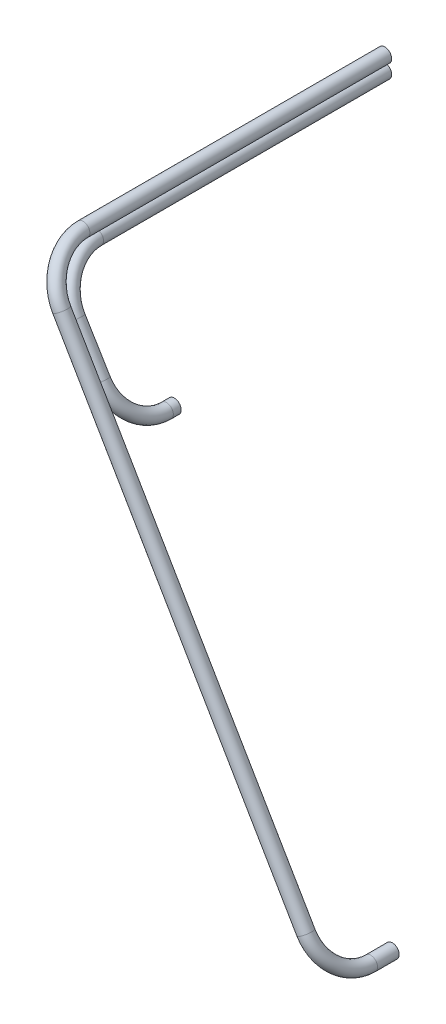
ISO-10303-21;
HEADER;
FILE_DESCRIPTION(('STEP AP214'),'2;1');
FILE_NAME('part.step','',(''),(''),'','','');
FILE_SCHEMA(('AUTOMOTIVE_DESIGN { 1 0 10303 214 1 1 1 1 }'));
ENDSEC;
DATA;
#1=APPLICATION_CONTEXT('core data for automotive mechanical design processes');
#2=APPLICATION_PROTOCOL_DEFINITION('international standard','automotive_design',2000,#1);
#3=PRODUCT_CONTEXT('',#1,'mechanical');
#4=PRODUCT('Part','Part','',(#3));
#5=PRODUCT_RELATED_PRODUCT_CATEGORY('part','',(#4));
#6=PRODUCT_DEFINITION_FORMATION('','',#4);
#7=PRODUCT_DEFINITION_CONTEXT('part definition',#1,'design');
#8=PRODUCT_DEFINITION('design','',#6,#7);
#9=PRODUCT_DEFINITION_SHAPE('','',#8);
#10=(LENGTH_UNIT() NAMED_UNIT(*) SI_UNIT(.MILLI.,.METRE.));
#11=(NAMED_UNIT(*) PLANE_ANGLE_UNIT() SI_UNIT($,.RADIAN.));
#12=(NAMED_UNIT(*) SI_UNIT($,.STERADIAN.) SOLID_ANGLE_UNIT());
#13=UNCERTAINTY_MEASURE_WITH_UNIT(LENGTH_MEASURE(1.E-05),#10,'distance_accuracy_value','');
#14=(GEOMETRIC_REPRESENTATION_CONTEXT(3) GLOBAL_UNCERTAINTY_ASSIGNED_CONTEXT((#13)) GLOBAL_UNIT_ASSIGNED_CONTEXT((#10,
#11,#12)) REPRESENTATION_CONTEXT('',''));
#15=CARTESIAN_POINT('',(0.,0.,0.));
#16=DIRECTION('',(0.,0.,1.));
#17=DIRECTION('',(1.,0.,0.));
#18=AXIS2_PLACEMENT_3D('',#15,#16,#17);
#19=CARTESIAN_POINT('',(-361.,-123.18,18.0548000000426));
#20=DIRECTION('',(0.,0.,-1.));
#21=DIRECTION('',(-1.,0.,0.));
#22=AXIS2_PLACEMENT_3D('',#19,#20,#21);
#23=CYLINDRICAL_SURFACE('',#22,1.58749999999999);
#24=CARTESIAN_POINT('',(-361.,-123.18,18.0548000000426));
#25=DIRECTION('',(0.,0.,-1.));
#26=DIRECTION('',(0.464011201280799,0.88582933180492,0.));
#27=AXIS2_PLACEMENT_3D('',#24,#25,#26);
#28=CIRCLE('',#27,1.58749999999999);
#29=CARTESIAN_POINT('',(-361.821819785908,-121.82177745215,18.0548000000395));
#30=VERTEX_POINT('',#29);
#31=EDGE_CURVE('E47',#30,#30,#28,.T.);
#32=ORIENTED_EDGE('',*,*,#31,.T.);
#33=EDGE_LOOP('',(#32));
#34=FACE_BOUND('',#33,.T.);
#35=CARTESIAN_POINT('',(-361.,-123.18,-48.7651999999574));
#36=DIRECTION('',(0.,0.,-1.));
#37=DIRECTION('',(0.464011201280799,0.88582933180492,0.));
#38=AXIS2_PLACEMENT_3D('',#35,#36,#37);
#39=CIRCLE('',#38,1.58749999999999);
#40=CARTESIAN_POINT('',(-360.263382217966,-121.77374593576,-48.7651999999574));
#41=VERTEX_POINT('',#40);
#42=EDGE_CURVE('E11',#41,#41,#39,.T.);
#43=ORIENTED_EDGE('',*,*,#42,.F.);
#44=EDGE_LOOP('',(#43));
#45=FACE_BOUND('',#44,.T.);
#46=ADVANCED_FACE('F37',(#34,#45),#23,.T.);
#47=CARTESIAN_POINT('',(-361.,-123.18,18.0548000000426));
#48=DIRECTION('',(0.,0.,-1.));
#49=DIRECTION('',(-1.,0.,0.));
#50=AXIS2_PLACEMENT_3D('',#47,#48,#49);
#51=CYLINDRICAL_SURFACE('',#50,0.793750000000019);
#52=CARTESIAN_POINT('',(-361.,-123.18,18.0548000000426));
#53=DIRECTION('',(0.,0.,-1.));
#54=DIRECTION('',(0.464011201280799,0.88582933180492,0.));
#55=AXIS2_PLACEMENT_3D('',#52,#53,#54);
#56=CIRCLE('',#55,0.793750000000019);
#57=CARTESIAN_POINT('',(-361.410909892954,-122.500888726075,18.0548000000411));
#58=VERTEX_POINT('',#57);
#59=EDGE_CURVE('E51',#58,#58,#56,.T.);
#60=ORIENTED_EDGE('',*,*,#59,.F.);
#61=EDGE_LOOP('',(#60));
#62=FACE_BOUND('',#61,.T.);
#63=CARTESIAN_POINT('',(-361.,-123.18,-48.7651999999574));
#64=DIRECTION('',(0.,0.,-1.));
#65=DIRECTION('',(0.464011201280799,0.88582933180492,0.));
#66=AXIS2_PLACEMENT_3D('',#63,#64,#65);
#67=CIRCLE('',#66,0.793750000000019);
#68=CARTESIAN_POINT('',(-360.631691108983,-122.47687296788,-48.7651999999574));
#69=VERTEX_POINT('',#68);
#70=EDGE_CURVE('E43',#69,#69,#67,.T.);
#71=ORIENTED_EDGE('',*,*,#70,.T.);
#72=EDGE_LOOP('',(#71));
#73=FACE_BOUND('',#72,.T.);
#74=ADVANCED_FACE('F105',(#62,#73),#51,.F.);
#75=CARTESIAN_POINT('',(-355.823182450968,-131.735732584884,18.0548000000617));
#76=DIRECTION('',(-0.855573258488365,-0.517681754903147,0.));
#77=DIRECTION('',(0.517681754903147,-0.855573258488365,0.));
#78=AXIS2_PLACEMENT_3D('',#75,#76,#77);
#79=TOROIDAL_SURFACE('',#78,9.99999999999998,1.58749999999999);
#80=CARTESIAN_POINT('',(-355.823182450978,-131.735732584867,28.0548000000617));
#81=DIRECTION('',(-0.517681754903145,0.855573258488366,0.));
#82=DIRECTION('',(0.7320056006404,0.442914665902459,0.517681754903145));
#83=AXIS2_PLACEMENT_3D('',#80,#81,#82);
#84=CIRCLE('',#83,1.58749999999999);
#85=CARTESIAN_POINT('',(-355.82318245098,-131.735732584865,29.6423000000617));
#86=VERTEX_POINT('',#85);
#87=EDGE_CURVE('E56',#86,#86,#84,.T.);
#88=CARTESIAN_POINT('',(-355.823182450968,-131.735732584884,18.0548000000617));
#89=DIRECTION('',(-0.855573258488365,-0.517681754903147,0.));
#90=DIRECTION('',(0.517681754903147,-0.855573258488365,0.));
#91=AXIS2_PLACEMENT_3D('',#88,#89,#90);
#92=CIRCLE('',#91,11.5875);
#93=EDGE_CURVE('',#86,#30,#92,.T.);
#94=ORIENTED_EDGE('',*,*,#87,.T.);
#95=ORIENTED_EDGE('',*,*,#31,.F.);
#96=ORIENTED_EDGE('',*,*,#93,.T.);
#97=ORIENTED_EDGE('',*,*,#93,.F.);
#98=EDGE_LOOP('',(#94,#96,#95,#97));
#99=FACE_BOUND('',#98,.T.);
#100=ADVANCED_FACE('F101',(#99),#79,.T.);
#101=CARTESIAN_POINT('',(-355.823182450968,-131.735732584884,18.0548000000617));
#102=DIRECTION('',(-0.855573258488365,-0.517681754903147,0.));
#103=DIRECTION('',(0.517681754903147,-0.855573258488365,0.));
#104=AXIS2_PLACEMENT_3D('',#101,#102,#103);
#105=TOROIDAL_SURFACE('',#104,9.99999999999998,0.793750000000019);
#106=CARTESIAN_POINT('',(-355.823182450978,-131.735732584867,28.0548000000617));
#107=DIRECTION('',(-0.517681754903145,0.855573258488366,0.));
#108=DIRECTION('',(0.7320056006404,0.442914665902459,0.517681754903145));
#109=AXIS2_PLACEMENT_3D('',#106,#107,#108);
#110=CIRCLE('',#109,0.793750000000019);
#111=CARTESIAN_POINT('',(-355.823182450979,-131.735732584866,28.8485500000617));
#112=VERTEX_POINT('',#111);
#113=EDGE_CURVE('E59',#112,#112,#110,.T.);
#114=CARTESIAN_POINT('',(-355.823182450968,-131.735732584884,18.0548000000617));
#115=DIRECTION('',(-0.855573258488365,-0.517681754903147,0.));
#116=DIRECTION('',(0.517681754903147,-0.855573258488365,0.));
#117=AXIS2_PLACEMENT_3D('',#114,#115,#116);
#118=CIRCLE('',#117,10.79375);
#119=EDGE_CURVE('',#112,#58,#118,.T.);
#120=ORIENTED_EDGE('',*,*,#113,.F.);
#121=ORIENTED_EDGE('',*,*,#59,.T.);
#122=ORIENTED_EDGE('',*,*,#119,.T.);
#123=ORIENTED_EDGE('',*,*,#119,.F.);
#124=EDGE_LOOP('',(#120,#122,#121,#123));
#125=FACE_BOUND('',#124,.T.);
#126=ADVANCED_FACE('F98',(#125),#105,.F.);
#127=CARTESIAN_POINT('',(-349.991405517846,-141.373917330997,28.0548000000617));
#128=DIRECTION('',(-0.517681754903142,0.855573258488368,0.));
#129=DIRECTION('',(-0.855573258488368,-0.517681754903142,0.));
#130=AXIS2_PLACEMENT_3D('',#127,#128,#129);
#131=CYLINDRICAL_SURFACE('',#130,1.58749999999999);
#132=CARTESIAN_POINT('',(-349.991405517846,-141.373917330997,28.0548000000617));
#133=DIRECTION('',(-0.517681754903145,0.855573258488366,0.));
#134=DIRECTION('',(0.7320056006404,0.442914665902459,0.517681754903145));
#135=AXIS2_PLACEMENT_3D('',#132,#133,#134);
#136=CIRCLE('',#135,1.58749999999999);
#137=CARTESIAN_POINT('',(-349.991405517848,-141.373917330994,29.6423000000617));
#138=VERTEX_POINT('',#137);
#139=EDGE_CURVE('E62',#138,#138,#136,.T.);
#140=ORIENTED_EDGE('',*,*,#139,.T.);
#141=EDGE_LOOP('',(#140));
#142=FACE_BOUND('',#141,.T.);
#143=ORIENTED_EDGE('',*,*,#87,.F.);
#144=EDGE_LOOP('',(#143));
#145=FACE_BOUND('',#144,.T.);
#146=ADVANCED_FACE('F94',(#142,#145),#131,.T.);
#147=CARTESIAN_POINT('',(-349.991405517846,-141.373917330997,28.0548000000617));
#148=DIRECTION('',(-0.517681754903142,0.855573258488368,0.));
#149=DIRECTION('',(-0.855573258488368,-0.517681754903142,0.));
#150=AXIS2_PLACEMENT_3D('',#147,#148,#149);
#151=CYLINDRICAL_SURFACE('',#150,0.793750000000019);
#152=CARTESIAN_POINT('',(-349.991405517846,-141.373917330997,28.0548000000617));
#153=DIRECTION('',(-0.517681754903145,0.855573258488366,0.));
#154=DIRECTION('',(0.7320056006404,0.442914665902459,0.517681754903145));
#155=AXIS2_PLACEMENT_3D('',#152,#153,#154);
#156=CIRCLE('',#155,0.793750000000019);
#157=CARTESIAN_POINT('',(-349.991405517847,-141.373917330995,28.8485500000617));
#158=VERTEX_POINT('',#157);
#159=EDGE_CURVE('E65',#158,#158,#156,.T.);
#160=ORIENTED_EDGE('',*,*,#159,.F.);
#161=EDGE_LOOP('',(#160));
#162=FACE_BOUND('',#161,.T.);
#163=ORIENTED_EDGE('',*,*,#113,.T.);
#164=EDGE_LOOP('',(#163));
#165=FACE_BOUND('',#164,.T.);
#166=ADVANCED_FACE('F91',(#162,#165),#151,.F.);
#167=CARTESIAN_POINT('',(-349.991405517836,-141.373917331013,18.0548000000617));
#168=DIRECTION('',(-0.855573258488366,-0.517681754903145,0.));
#169=DIRECTION('',(0.517681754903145,-0.855573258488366,0.));
#170=AXIS2_PLACEMENT_3D('',#167,#168,#169);
#171=TOROIDAL_SURFACE('',#170,9.99999999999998,1.58749999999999);
#172=CARTESIAN_POINT('',(-344.814587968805,-149.929649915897,18.0548000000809));
#173=DIRECTION('',(0.,0.,1.));
#174=DIRECTION('',(1.,0.,0.));
#175=AXIS2_PLACEMENT_3D('',#172,#173,#174);
#176=CIRCLE('',#175,1.58749999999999);
#177=CARTESIAN_POINT('',(-343.992768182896,-151.287872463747,18.0548000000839));
#178=VERTEX_POINT('',#177);
#179=EDGE_CURVE('E68',#178,#178,#176,.T.);
#180=CARTESIAN_POINT('',(-349.991405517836,-141.373917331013,18.0548000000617));
#181=DIRECTION('',(-0.855573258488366,-0.517681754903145,0.));
#182=DIRECTION('',(0.517681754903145,-0.855573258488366,0.));
#183=AXIS2_PLACEMENT_3D('',#180,#181,#182);
#184=CIRCLE('',#183,11.5875);
#185=EDGE_CURVE('',#178,#138,#184,.T.);
#186=ORIENTED_EDGE('',*,*,#179,.T.);
#187=ORIENTED_EDGE('',*,*,#139,.F.);
#188=ORIENTED_EDGE('',*,*,#185,.T.);
#189=ORIENTED_EDGE('',*,*,#185,.F.);
#190=EDGE_LOOP('',(#186,#188,#187,#189));
#191=FACE_BOUND('',#190,.T.);
#192=ADVANCED_FACE('F87',(#191),#171,.T.);
#193=CARTESIAN_POINT('',(-349.991405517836,-141.373917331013,18.0548000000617));
#194=DIRECTION('',(-0.855573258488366,-0.517681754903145,0.));
#195=DIRECTION('',(0.517681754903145,-0.855573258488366,0.));
#196=AXIS2_PLACEMENT_3D('',#193,#194,#195);
#197=TOROIDAL_SURFACE('',#196,9.99999999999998,0.793750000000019);
#198=CARTESIAN_POINT('',(-344.814587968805,-149.929649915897,18.0548000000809));
#199=DIRECTION('',(0.,0.,1.));
#200=DIRECTION('',(1.,0.,0.));
#201=AXIS2_PLACEMENT_3D('',#198,#199,#200);
#202=CIRCLE('',#201,0.793750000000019);
#203=CARTESIAN_POINT('',(-344.403678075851,-150.608761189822,18.0548000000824));
#204=VERTEX_POINT('',#203);
#205=EDGE_CURVE('E72',#204,#204,#202,.T.);
#206=CARTESIAN_POINT('',(-349.991405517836,-141.373917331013,18.0548000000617));
#207=DIRECTION('',(-0.855573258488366,-0.517681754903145,0.));
#208=DIRECTION('',(0.517681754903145,-0.855573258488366,0.));
#209=AXIS2_PLACEMENT_3D('',#206,#207,#208);
#210=CIRCLE('',#209,10.79375);
#211=EDGE_CURVE('',#204,#158,#210,.T.);
#212=ORIENTED_EDGE('',*,*,#205,.F.);
#213=ORIENTED_EDGE('',*,*,#159,.T.);
#214=ORIENTED_EDGE('',*,*,#211,.T.);
#215=ORIENTED_EDGE('',*,*,#211,.F.);
#216=EDGE_LOOP('',(#212,#214,#213,#215));
#217=FACE_BOUND('',#216,.T.);
#218=ADVANCED_FACE('F84',(#217),#197,.F.);
#219=CARTESIAN_POINT('',(-344.814587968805,-149.929649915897,18.0548000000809));
#220=DIRECTION('',(0.,0.,-1.));
#221=DIRECTION('',(-1.,0.,0.));
#222=AXIS2_PLACEMENT_3D('',#219,#220,#221);
#223=CYLINDRICAL_SURFACE('',#222,0.793750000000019);
#224=ORIENTED_EDGE('',*,*,#205,.T.);
#225=EDGE_LOOP('',(#224));
#226=FACE_BOUND('',#225,.T.);
#227=CARTESIAN_POINT('',(-344.814587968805,-149.929649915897,16.2348));
#228=DIRECTION('',(0.,0.,1.));
#229=DIRECTION('',(1.,0.,0.));
#230=AXIS2_PLACEMENT_3D('',#227,#228,#229);
#231=CIRCLE('',#230,0.793750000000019);
#232=CARTESIAN_POINT('',(-344.020837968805,-149.929649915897,16.2348));
#233=VERTEX_POINT('',#232);
#234=EDGE_CURVE('E73',#233,#233,#231,.T.);
#235=ORIENTED_EDGE('',*,*,#234,.F.);
#236=EDGE_LOOP('',(#235));
#237=FACE_BOUND('',#236,.T.);
#238=ADVANCED_FACE('F81',(#226,#237),#223,.F.);
#239=CARTESIAN_POINT('',(-344.814587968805,-149.929649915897,18.0548000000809));
#240=DIRECTION('',(0.,0.,-1.));
#241=DIRECTION('',(-1.,0.,0.));
#242=AXIS2_PLACEMENT_3D('',#239,#240,#241);
#243=CYLINDRICAL_SURFACE('',#242,1.58749999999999);
#244=ORIENTED_EDGE('',*,*,#179,.F.);
#245=EDGE_LOOP('',(#244));
#246=FACE_BOUND('',#245,.T.);
#247=CARTESIAN_POINT('',(-344.814587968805,-149.929649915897,16.2348));
#248=DIRECTION('',(0.,0.,1.));
#249=DIRECTION('',(1.,0.,0.));
#250=AXIS2_PLACEMENT_3D('',#247,#248,#249);
#251=CIRCLE('',#250,1.58749999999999);
#252=CARTESIAN_POINT('',(-343.227087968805,-149.929649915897,16.2348));
#253=VERTEX_POINT('',#252);
#254=EDGE_CURVE('E69',#253,#253,#251,.T.);
#255=ORIENTED_EDGE('',*,*,#254,.T.);
#256=EDGE_LOOP('',(#255));
#257=FACE_BOUND('',#256,.T.);
#258=ADVANCED_FACE('F123',(#246,#257),#243,.T.);
#259=CARTESIAN_POINT('',(-361.,-123.18,-48.7651999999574));
#260=DIRECTION('',(0.,0.,-1.));
#261=DIRECTION('',(0.464011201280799,0.88582933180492,0.));
#262=AXIS2_PLACEMENT_3D('',#259,#260,#261);
#263=PLANE('',#262);
#264=ORIENTED_EDGE('',*,*,#70,.F.);
#265=EDGE_LOOP('',(#264));
#266=FACE_BOUND('',#265,.T.);
#267=ORIENTED_EDGE('',*,*,#42,.T.);
#268=EDGE_LOOP('',(#267));
#269=FACE_BOUND('',#268,.T.);
#270=ADVANCED_FACE('F126',(#266,#269),#263,.T.);
#271=CARTESIAN_POINT('',(-344.814587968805,-149.929649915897,16.2348));
#272=DIRECTION('',(0.,0.,1.));
#273=DIRECTION('',(1.,0.,0.));
#274=AXIS2_PLACEMENT_3D('',#271,#272,#273);
#275=PLANE('',#274);
#276=ORIENTED_EDGE('',*,*,#234,.T.);
#277=EDGE_LOOP('',(#276));
#278=FACE_BOUND('',#277,.T.);
#279=ORIENTED_EDGE('',*,*,#254,.F.);
#280=EDGE_LOOP('',(#279));
#281=FACE_BOUND('',#280,.T.);
#282=ADVANCED_FACE('F128',(#278,#281),#275,.F.);
#283=CLOSED_SHELL('',(#46,#74,#100,#126,#146,#166,#192,#218,#238,#258,#270,#282));
#284=MANIFOLD_SOLID_BREP('B2',#283);
#285=CARTESIAN_POINT('',(-361.,-120.,21.2348000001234));
#286=DIRECTION('',(0.,0.,-1.));
#287=DIRECTION('',(-1.,0.,0.));
#288=AXIS2_PLACEMENT_3D('',#285,#286,#287);
#289=CYLINDRICAL_SURFACE('',#288,1.58750000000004);
#290=CARTESIAN_POINT('',(-361.,-120.,21.2348000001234));
#291=DIRECTION('',(0.,0.,-1.));
#292=DIRECTION('',(0.489937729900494,0.871757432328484,0.));
#293=AXIS2_PLACEMENT_3D('',#290,#291,#292);
#294=CIRCLE('',#293,1.58750000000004);
#295=CARTESIAN_POINT('',(-361.801697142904,-118.629803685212,21.2348000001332));
#296=VERTEX_POINT('',#295);
#297=EDGE_CURVE('E229',#296,#296,#294,.T.);
#298=ORIENTED_EDGE('',*,*,#297,.T.);
#299=EDGE_LOOP('',(#298));
#300=FACE_BOUND('',#299,.T.);
#301=CARTESIAN_POINT('',(-361.,-120.,-48.7651999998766));
#302=DIRECTION('',(0.,0.,-1.));
#303=DIRECTION('',(0.489937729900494,0.871757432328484,0.));
#304=AXIS2_PLACEMENT_3D('',#301,#302,#303);
#305=CIRCLE('',#304,1.58750000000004);
#306=CARTESIAN_POINT('',(-360.222223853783,-118.616085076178,-48.7651999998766));
#307=VERTEX_POINT('',#306);
#308=EDGE_CURVE('E36',#307,#307,#305,.T.);
#309=ORIENTED_EDGE('',*,*,#308,.F.);
#310=EDGE_LOOP('',(#309));
#311=FACE_BOUND('',#310,.T.);
#312=ADVANCED_FACE('F219',(#300,#311),#289,.T.);
#313=CARTESIAN_POINT('',(-361.,-120.,21.2348000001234));
#314=DIRECTION('',(0.,0.,-1.));
#315=DIRECTION('',(-1.,0.,0.));
#316=AXIS2_PLACEMENT_3D('',#313,#314,#315);
#317=CYLINDRICAL_SURFACE('',#316,0.793749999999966);
#318=CARTESIAN_POINT('',(-361.,-120.,21.2348000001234));
#319=DIRECTION('',(0.,0.,-1.));
#320=DIRECTION('',(0.489937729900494,0.871757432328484,0.));
#321=AXIS2_PLACEMENT_3D('',#318,#319,#320);
#322=CIRCLE('',#321,0.793749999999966);
#323=CARTESIAN_POINT('',(-361.400848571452,-119.314901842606,21.2348000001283));
#324=VERTEX_POINT('',#323);
#325=EDGE_CURVE('E233',#324,#324,#322,.T.);
#326=ORIENTED_EDGE('',*,*,#325,.F.);
#327=EDGE_LOOP('',(#326));
#328=FACE_BOUND('',#327,.T.);
#329=CARTESIAN_POINT('',(-361.,-120.,-48.7651999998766));
#330=DIRECTION('',(0.,0.,-1.));
#331=DIRECTION('',(0.489937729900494,0.871757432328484,0.));
#332=AXIS2_PLACEMENT_3D('',#329,#330,#331);
#333=CIRCLE('',#332,0.793749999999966);
#334=CARTESIAN_POINT('',(-360.611111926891,-119.308042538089,-48.7651999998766));
#335=VERTEX_POINT('',#334);
#336=EDGE_CURVE('E225',#335,#335,#333,.T.);
#337=ORIENTED_EDGE('',*,*,#336,.T.);
#338=EDGE_LOOP('',(#337));
#339=FACE_BOUND('',#338,.T.);
#340=ADVANCED_FACE('F287',(#328,#339),#317,.F.);
#341=CARTESIAN_POINT('',(-355.949939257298,-128.631157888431,21.2348000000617));
#342=DIRECTION('',(-0.863115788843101,-0.505006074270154,0.));
#343=DIRECTION('',(0.505006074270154,-0.863115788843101,0.));
#344=AXIS2_PLACEMENT_3D('',#341,#342,#343);
#345=TOROIDAL_SURFACE('',#344,10.,1.58750000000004);
#346=CARTESIAN_POINT('',(-355.949939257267,-128.631157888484,31.2348000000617));
#347=DIRECTION('',(-0.505006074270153,0.863115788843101,0.));
#348=DIRECTION('',(0.744968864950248,0.43587871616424,0.505006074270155));
#349=AXIS2_PLACEMENT_3D('',#346,#347,#348);
#350=CIRCLE('',#349,1.58750000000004);
#351=CARTESIAN_POINT('',(-355.949939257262,-128.631157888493,32.8223000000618));
#352=VERTEX_POINT('',#351);
#353=EDGE_CURVE('E238',#352,#352,#350,.T.);
#354=CARTESIAN_POINT('',(-355.949939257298,-128.631157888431,21.2348000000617));
#355=DIRECTION('',(-0.863115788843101,-0.505006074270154,0.));
#356=DIRECTION('',(0.505006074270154,-0.863115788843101,0.));
#357=AXIS2_PLACEMENT_3D('',#354,#355,#356);
#358=CIRCLE('',#357,11.5875000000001);
#359=EDGE_CURVE('',#352,#296,#358,.T.);
#360=ORIENTED_EDGE('',*,*,#353,.T.);
#361=ORIENTED_EDGE('',*,*,#297,.F.);
#362=ORIENTED_EDGE('',*,*,#359,.T.);
#363=ORIENTED_EDGE('',*,*,#359,.F.);
#364=EDGE_LOOP('',(#360,#362,#361,#363));
#365=FACE_BOUND('',#364,.T.);
#366=ADVANCED_FACE('F283',(#365),#345,.T.);
#367=CARTESIAN_POINT('',(-355.949939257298,-128.631157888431,21.2348000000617));
#368=DIRECTION('',(-0.863115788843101,-0.505006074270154,0.));
#369=DIRECTION('',(0.505006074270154,-0.863115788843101,0.));
#370=AXIS2_PLACEMENT_3D('',#367,#368,#369);
#371=TOROIDAL_SURFACE('',#370,10.,0.793749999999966);
#372=CARTESIAN_POINT('',(-355.949939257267,-128.631157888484,31.2348000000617));
#373=DIRECTION('',(-0.505006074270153,0.863115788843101,0.));
#374=DIRECTION('',(0.744968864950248,0.43587871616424,0.505006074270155));
#375=AXIS2_PLACEMENT_3D('',#372,#373,#374);
#376=CIRCLE('',#375,0.793749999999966);
#377=CARTESIAN_POINT('',(-355.949939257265,-128.631157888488,32.0285500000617));
#378=VERTEX_POINT('',#377);
#379=EDGE_CURVE('E241',#378,#378,#376,.T.);
#380=CARTESIAN_POINT('',(-355.949939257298,-128.631157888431,21.2348000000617));
#381=DIRECTION('',(-0.863115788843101,-0.505006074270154,0.));
#382=DIRECTION('',(0.505006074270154,-0.863115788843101,0.));
#383=AXIS2_PLACEMENT_3D('',#380,#381,#382);
#384=CIRCLE('',#383,10.79375);
#385=EDGE_CURVE('',#378,#324,#384,.T.);
#386=ORIENTED_EDGE('',*,*,#379,.F.);
#387=ORIENTED_EDGE('',*,*,#325,.T.);
#388=ORIENTED_EDGE('',*,*,#385,.T.);
#389=ORIENTED_EDGE('',*,*,#385,.F.);
#390=EDGE_LOOP('',(#386,#388,#387,#389));
#391=FACE_BOUND('',#390,.T.);
#392=ADVANCED_FACE('F280',(#391),#371,.F.);
#393=CARTESIAN_POINT('',(-299.310727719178,-225.434345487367,31.2348000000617));
#394=DIRECTION('',(-0.505006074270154,0.863115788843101,0.));
#395=DIRECTION('',(-0.863115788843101,-0.505006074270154,0.));
#396=AXIS2_PLACEMENT_3D('',#393,#394,#395);
#397=CYLINDRICAL_SURFACE('',#396,1.58750000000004);
#398=CARTESIAN_POINT('',(-299.310727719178,-225.434345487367,31.2348000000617));
#399=DIRECTION('',(-0.505006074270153,0.863115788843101,0.));
#400=DIRECTION('',(0.744968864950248,0.43587871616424,0.505006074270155));
#401=AXIS2_PLACEMENT_3D('',#398,#399,#400);
#402=CIRCLE('',#401,1.58750000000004);
#403=CARTESIAN_POINT('',(-299.310727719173,-225.434345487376,32.8223000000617));
#404=VERTEX_POINT('',#403);
#405=EDGE_CURVE('E244',#404,#404,#402,.T.);
#406=ORIENTED_EDGE('',*,*,#405,.T.);
#407=EDGE_LOOP('',(#406));
#408=FACE_BOUND('',#407,.T.);
#409=ORIENTED_EDGE('',*,*,#353,.F.);
#410=EDGE_LOOP('',(#409));
#411=FACE_BOUND('',#410,.T.);
#412=ADVANCED_FACE('F276',(#408,#411),#397,.T.);
#413=CARTESIAN_POINT('',(-299.310727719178,-225.434345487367,31.2348000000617));
#414=DIRECTION('',(-0.505006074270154,0.863115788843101,0.));
#415=DIRECTION('',(-0.863115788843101,-0.505006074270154,0.));
#416=AXIS2_PLACEMENT_3D('',#413,#414,#415);
#417=CYLINDRICAL_SURFACE('',#416,0.793749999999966);
#418=CARTESIAN_POINT('',(-299.310727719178,-225.434345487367,31.2348000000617));
#419=DIRECTION('',(-0.505006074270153,0.863115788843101,0.));
#420=DIRECTION('',(0.744968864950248,0.43587871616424,0.505006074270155));
#421=AXIS2_PLACEMENT_3D('',#418,#419,#420);
#422=CIRCLE('',#421,0.793749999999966);
#423=CARTESIAN_POINT('',(-299.310727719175,-225.434345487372,32.0285500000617));
#424=VERTEX_POINT('',#423);
#425=EDGE_CURVE('E247',#424,#424,#422,.T.);
#426=ORIENTED_EDGE('',*,*,#425,.F.);
#427=EDGE_LOOP('',(#426));
#428=FACE_BOUND('',#427,.T.);
#429=ORIENTED_EDGE('',*,*,#379,.T.);
#430=EDGE_LOOP('',(#429));
#431=FACE_BOUND('',#430,.T.);
#432=ADVANCED_FACE('F273',(#428,#431),#417,.F.);
#433=CARTESIAN_POINT('',(-299.310727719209,-225.434345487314,21.2348000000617));
#434=DIRECTION('',(-0.863115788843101,-0.505006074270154,0.));
#435=DIRECTION('',(0.505006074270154,-0.863115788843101,0.));
#436=AXIS2_PLACEMENT_3D('',#433,#434,#435);
#437=TOROIDAL_SURFACE('',#436,9.99999999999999,1.58750000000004);
#438=CARTESIAN_POINT('',(-294.260666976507,-234.065503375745,21.2348));
#439=DIRECTION('',(0.,0.,1.));
#440=DIRECTION('',(1.,0.,0.));
#441=AXIS2_PLACEMENT_3D('',#438,#439,#440);
#442=CIRCLE('',#441,1.58750000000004);
#443=CARTESIAN_POINT('',(-293.458969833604,-235.435699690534,21.2347999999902));
#444=VERTEX_POINT('',#443);
#445=EDGE_CURVE('E250',#444,#444,#442,.T.);
#446=CARTESIAN_POINT('',(-299.310727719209,-225.434345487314,21.2348000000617));
#447=DIRECTION('',(-0.863115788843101,-0.505006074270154,0.));
#448=DIRECTION('',(0.505006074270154,-0.863115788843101,0.));
#449=AXIS2_PLACEMENT_3D('',#446,#447,#448);
#450=CIRCLE('',#449,11.5875);
#451=EDGE_CURVE('',#444,#404,#450,.T.);
#452=ORIENTED_EDGE('',*,*,#445,.T.);
#453=ORIENTED_EDGE('',*,*,#405,.F.);
#454=ORIENTED_EDGE('',*,*,#451,.T.);
#455=ORIENTED_EDGE('',*,*,#451,.F.);
#456=EDGE_LOOP('',(#452,#454,#453,#455));
#457=FACE_BOUND('',#456,.T.);
#458=ADVANCED_FACE('F269',(#457),#437,.T.);
#459=CARTESIAN_POINT('',(-299.310727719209,-225.434345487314,21.2348000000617));
#460=DIRECTION('',(-0.863115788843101,-0.505006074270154,0.));
#461=DIRECTION('',(0.505006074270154,-0.863115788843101,0.));
#462=AXIS2_PLACEMENT_3D('',#459,#460,#461);
#463=TOROIDAL_SURFACE('',#462,9.99999999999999,0.793749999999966);
#464=CARTESIAN_POINT('',(-294.260666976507,-234.065503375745,21.2348));
#465=DIRECTION('',(0.,0.,1.));
#466=DIRECTION('',(1.,0.,0.));
#467=AXIS2_PLACEMENT_3D('',#464,#465,#466);
#468=CIRCLE('',#467,0.793749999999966);
#469=CARTESIAN_POINT('',(-293.859818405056,-234.750601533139,21.2347999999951));
#470=VERTEX_POINT('',#469);
#471=EDGE_CURVE('E254',#470,#470,#468,.T.);
#472=CARTESIAN_POINT('',(-299.310727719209,-225.434345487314,21.2348000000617));
#473=DIRECTION('',(-0.863115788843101,-0.505006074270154,0.));
#474=DIRECTION('',(0.505006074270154,-0.863115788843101,0.));
#475=AXIS2_PLACEMENT_3D('',#472,#473,#474);
#476=CIRCLE('',#475,10.79375);
#477=EDGE_CURVE('',#470,#424,#476,.T.);
#478=ORIENTED_EDGE('',*,*,#471,.F.);
#479=ORIENTED_EDGE('',*,*,#425,.T.);
#480=ORIENTED_EDGE('',*,*,#477,.T.);
#481=ORIENTED_EDGE('',*,*,#477,.F.);
#482=EDGE_LOOP('',(#478,#480,#479,#481));
#483=FACE_BOUND('',#482,.T.);
#484=ADVANCED_FACE('F266',(#483),#463,.F.);
#485=CARTESIAN_POINT('',(-294.260666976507,-234.065503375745,21.2348));
#486=DIRECTION('',(0.,0.,-1.));
#487=DIRECTION('',(-1.,0.,0.));
#488=AXIS2_PLACEMENT_3D('',#485,#486,#487);
#489=CYLINDRICAL_SURFACE('',#488,0.793749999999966);
#490=ORIENTED_EDGE('',*,*,#471,.T.);
#491=EDGE_LOOP('',(#490));
#492=FACE_BOUND('',#491,.T.);
#493=CARTESIAN_POINT('',(-294.260666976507,-234.065503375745,16.2348));
#494=DIRECTION('',(0.,0.,1.));
#495=DIRECTION('',(1.,0.,0.));
#496=AXIS2_PLACEMENT_3D('',#493,#494,#495);
#497=CIRCLE('',#496,0.793749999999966);
#498=CARTESIAN_POINT('',(-293.466916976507,-234.065503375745,16.2348));
#499=VERTEX_POINT('',#498);
#500=EDGE_CURVE('E255',#499,#499,#497,.T.);
#501=ORIENTED_EDGE('',*,*,#500,.F.);
#502=EDGE_LOOP('',(#501));
#503=FACE_BOUND('',#502,.T.);
#504=ADVANCED_FACE('F263',(#492,#503),#489,.F.);
#505=CARTESIAN_POINT('',(-294.260666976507,-234.065503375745,21.2348));
#506=DIRECTION('',(0.,0.,-1.));
#507=DIRECTION('',(-1.,0.,0.));
#508=AXIS2_PLACEMENT_3D('',#505,#506,#507);
#509=CYLINDRICAL_SURFACE('',#508,1.58750000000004);
#510=ORIENTED_EDGE('',*,*,#445,.F.);
#511=EDGE_LOOP('',(#510));
#512=FACE_BOUND('',#511,.T.);
#513=CARTESIAN_POINT('',(-294.260666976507,-234.065503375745,16.2348));
#514=DIRECTION('',(0.,0.,1.));
#515=DIRECTION('',(1.,0.,0.));
#516=AXIS2_PLACEMENT_3D('',#513,#514,#515);
#517=CIRCLE('',#516,1.58750000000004);
#518=CARTESIAN_POINT('',(-292.673166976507,-234.065503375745,16.2348));
#519=VERTEX_POINT('',#518);
#520=EDGE_CURVE('E251',#519,#519,#517,.T.);
#521=ORIENTED_EDGE('',*,*,#520,.T.);
#522=EDGE_LOOP('',(#521));
#523=FACE_BOUND('',#522,.T.);
#524=ADVANCED_FACE('F305',(#512,#523),#509,.T.);
#525=CARTESIAN_POINT('',(-361.,-120.,-48.7651999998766));
#526=DIRECTION('',(0.,0.,-1.));
#527=DIRECTION('',(0.489937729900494,0.871757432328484,0.));
#528=AXIS2_PLACEMENT_3D('',#525,#526,#527);
#529=PLANE('',#528);
#530=ORIENTED_EDGE('',*,*,#336,.F.);
#531=EDGE_LOOP('',(#530));
#532=FACE_BOUND('',#531,.T.);
#533=ORIENTED_EDGE('',*,*,#308,.T.);
#534=EDGE_LOOP('',(#533));
#535=FACE_BOUND('',#534,.T.);
#536=ADVANCED_FACE('F308',(#532,#535),#529,.T.);
#537=CARTESIAN_POINT('',(-294.260666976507,-234.065503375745,16.2348));
#538=DIRECTION('',(0.,0.,1.));
#539=DIRECTION('',(1.,0.,0.));
#540=AXIS2_PLACEMENT_3D('',#537,#538,#539);
#541=PLANE('',#540);
#542=ORIENTED_EDGE('',*,*,#500,.T.);
#543=EDGE_LOOP('',(#542));
#544=FACE_BOUND('',#543,.T.);
#545=ORIENTED_EDGE('',*,*,#520,.F.);
#546=EDGE_LOOP('',(#545));
#547=FACE_BOUND('',#546,.T.);
#548=ADVANCED_FACE('F310',(#544,#547),#541,.F.);
#549=CLOSED_SHELL('',(#312,#340,#366,#392,#412,#432,#458,#484,#504,#524,#536,#548));
#550=MANIFOLD_SOLID_BREP('B6',#549);
#551=ADVANCED_BREP_SHAPE_REPRESENTATION('',(#18,#284,#550),#14);
#552=SHAPE_DEFINITION_REPRESENTATION(#9,#551);
ENDSEC;
END-ISO-10303-21;
